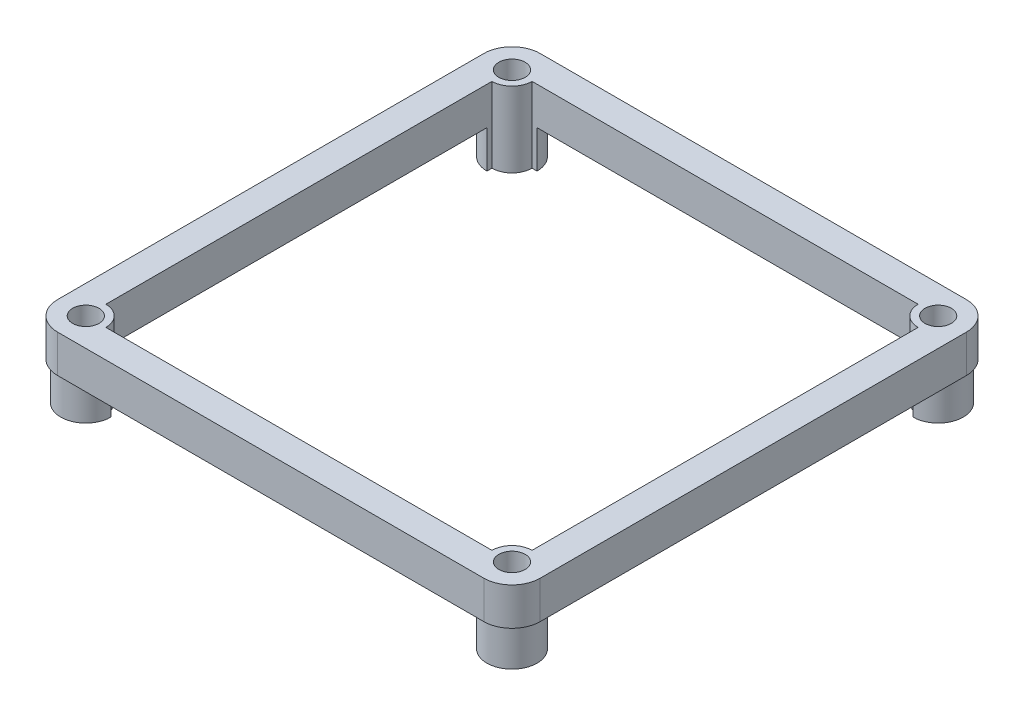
ISO-10303-21;
HEADER;
FILE_DESCRIPTION(('STEP AP214'),'2;1');
FILE_NAME('part.step','',(''),(''),'','','');
FILE_SCHEMA(('AUTOMOTIVE_DESIGN { 1 0 10303 214 1 1 1 1 }'));
ENDSEC;
DATA;
#1=APPLICATION_CONTEXT('core data for automotive mechanical design processes');
#2=APPLICATION_PROTOCOL_DEFINITION('international standard','automotive_design',2000,#1);
#3=PRODUCT_CONTEXT('',#1,'mechanical');
#4=PRODUCT('Part','Part','',(#3));
#5=PRODUCT_RELATED_PRODUCT_CATEGORY('part','',(#4));
#6=PRODUCT_DEFINITION_FORMATION('','',#4);
#7=PRODUCT_DEFINITION_CONTEXT('part definition',#1,'design');
#8=PRODUCT_DEFINITION('design','',#6,#7);
#9=PRODUCT_DEFINITION_SHAPE('','',#8);
#10=(LENGTH_UNIT() NAMED_UNIT(*) SI_UNIT(.MILLI.,.METRE.));
#11=(NAMED_UNIT(*) PLANE_ANGLE_UNIT() SI_UNIT($,.RADIAN.));
#12=(NAMED_UNIT(*) SI_UNIT($,.STERADIAN.) SOLID_ANGLE_UNIT());
#13=UNCERTAINTY_MEASURE_WITH_UNIT(LENGTH_MEASURE(1.E-05),#10,'distance_accuracy_value','');
#14=(GEOMETRIC_REPRESENTATION_CONTEXT(3) GLOBAL_UNCERTAINTY_ASSIGNED_CONTEXT((#13)) GLOBAL_UNIT_ASSIGNED_CONTEXT((#10,
#11,#12)) REPRESENTATION_CONTEXT('',''));
#15=CARTESIAN_POINT('',(0.,0.,0.));
#16=DIRECTION('',(0.,0.,1.));
#17=DIRECTION('',(1.,0.,0.));
#18=AXIS2_PLACEMENT_3D('',#15,#16,#17);
#19=CARTESIAN_POINT('',(0.,3.,-34.));
#20=DIRECTION('',(0.,1.,0.));
#21=DIRECTION('',(0.,0.,1.));
#22=AXIS2_PLACEMENT_3D('',#19,#20,#21);
#23=PLANE('',#22);
#24=CARTESIAN_POINT('',(0.,3.,-34.));
#25=DIRECTION('',(0.,1.,0.));
#26=DIRECTION('',(0.,0.,1.));
#27=AXIS2_PLACEMENT_3D('',#24,#25,#26);
#28=CIRCLE('',#27,2.25);
#29=CARTESIAN_POINT('',(0.,3.,-36.25));
#30=VERTEX_POINT('',#29);
#31=CARTESIAN_POINT('',(-2.25,3.,-34.));
#32=VERTEX_POINT('',#31);
#33=EDGE_CURVE('E366',#30,#32,#28,.T.);
#34=ORIENTED_EDGE('',*,*,#33,.F.);
#35=DIRECTION('',(-1.,0.,0.));
#36=VECTOR('',#35,1.);
#37=CARTESIAN_POINT('',(0.,3.,-36.25));
#38=LINE('',#37,#36);
#39=CARTESIAN_POINT('',(34.,3.,-36.25));
#40=VERTEX_POINT('',#39);
#41=EDGE_CURVE('E395',#40,#30,#38,.T.);
#42=ORIENTED_EDGE('',*,*,#41,.F.);
#43=CARTESIAN_POINT('',(34.,3.,-34.));
#44=DIRECTION('',(0.,1.,0.));
#45=DIRECTION('',(0.,0.,-1.));
#46=AXIS2_PLACEMENT_3D('',#43,#44,#45);
#47=CIRCLE('',#46,2.25);
#48=CARTESIAN_POINT('',(36.25,3.,-34.));
#49=VERTEX_POINT('',#48);
#50=EDGE_CURVE('E391',#49,#40,#47,.T.);
#51=ORIENTED_EDGE('',*,*,#50,.F.);
#52=DIRECTION('',(0.,0.,-1.));
#53=VECTOR('',#52,1.);
#54=CARTESIAN_POINT('',(36.25,3.,-34.));
#55=LINE('',#54,#53);
#56=CARTESIAN_POINT('',(36.25,3.,0.));
#57=VERTEX_POINT('',#56);
#58=EDGE_CURVE('E387',#57,#49,#55,.T.);
#59=ORIENTED_EDGE('',*,*,#58,.F.);
#60=CARTESIAN_POINT('',(34.,3.,0.));
#61=DIRECTION('',(0.,1.,0.));
#62=DIRECTION('',(0.,0.,-1.));
#63=AXIS2_PLACEMENT_3D('',#60,#61,#62);
#64=CIRCLE('',#63,2.25);
#65=CARTESIAN_POINT('',(34.,3.,2.25));
#66=VERTEX_POINT('',#65);
#67=EDGE_CURVE('E383',#66,#57,#64,.T.);
#68=ORIENTED_EDGE('',*,*,#67,.F.);
#69=DIRECTION('',(1.,0.,0.));
#70=VECTOR('',#69,1.);
#71=CARTESIAN_POINT('',(34.,3.,2.25));
#72=LINE('',#71,#70);
#73=CARTESIAN_POINT('',(0.,3.,2.25));
#74=VERTEX_POINT('',#73);
#75=EDGE_CURVE('E379',#74,#66,#72,.T.);
#76=ORIENTED_EDGE('',*,*,#75,.F.);
#77=CARTESIAN_POINT('',(0.,3.,0.));
#78=DIRECTION('',(0.,1.,0.));
#79=DIRECTION('',(0.,0.,-1.));
#80=AXIS2_PLACEMENT_3D('',#77,#78,#79);
#81=CIRCLE('',#80,2.25);
#82=CARTESIAN_POINT('',(-2.25,3.,0.));
#83=VERTEX_POINT('',#82);
#84=EDGE_CURVE('E375',#83,#74,#81,.T.);
#85=ORIENTED_EDGE('',*,*,#84,.F.);
#86=DIRECTION('',(0.,0.,1.));
#87=VECTOR('',#86,1.);
#88=CARTESIAN_POINT('',(-2.25,3.,0.));
#89=LINE('',#88,#87);
#90=EDGE_CURVE('E370',#32,#83,#89,.T.);
#91=ORIENTED_EDGE('',*,*,#90,.F.);
#92=EDGE_LOOP('',(#34,#42,#51,#59,#68,#76,#85,#91));
#93=FACE_BOUND('',#92,.T.);
#94=CARTESIAN_POINT('',(0.,3.,0.));
#95=DIRECTION('',(0.,1.,0.));
#96=DIRECTION('',(0.,0.,1.));
#97=AXIS2_PLACEMENT_3D('',#94,#95,#96);
#98=CIRCLE('',#97,2.);
#99=CARTESIAN_POINT('',(2.,3.,0.));
#100=VERTEX_POINT('',#99);
#101=CARTESIAN_POINT('',(0.,3.,-2.));
#102=VERTEX_POINT('',#101);
#103=EDGE_CURVE('E65',#100,#102,#98,.F.);
#104=ORIENTED_EDGE('',*,*,#103,.F.);
#105=DIRECTION('',(1.,0.,0.));
#106=VECTOR('',#105,1.);
#107=CARTESIAN_POINT('',(1.6,3.,0.));
#108=LINE('',#107,#106);
#109=CARTESIAN_POINT('',(32.,3.,0.));
#110=VERTEX_POINT('',#109);
#111=EDGE_CURVE('E337',#100,#110,#108,.T.);
#112=ORIENTED_EDGE('',*,*,#111,.T.);
#113=CARTESIAN_POINT('',(34.,3.,0.));
#114=DIRECTION('',(0.,1.,0.));
#115=DIRECTION('',(0.,0.,1.));
#116=AXIS2_PLACEMENT_3D('',#113,#114,#115);
#117=CIRCLE('',#116,2.);
#118=CARTESIAN_POINT('',(34.,3.,-2.));
#119=VERTEX_POINT('',#118);
#120=EDGE_CURVE('E282',#119,#110,#117,.F.);
#121=ORIENTED_EDGE('',*,*,#120,.F.);
#122=DIRECTION('',(0.,0.,-1.));
#123=VECTOR('',#122,1.);
#124=CARTESIAN_POINT('',(34.,3.,-1.6));
#125=LINE('',#124,#123);
#126=CARTESIAN_POINT('',(34.,3.,-32.));
#127=VERTEX_POINT('',#126);
#128=EDGE_CURVE('E328',#119,#127,#125,.T.);
#129=ORIENTED_EDGE('',*,*,#128,.T.);
#130=CARTESIAN_POINT('',(34.,3.,-34.));
#131=DIRECTION('',(0.,1.,0.));
#132=DIRECTION('',(0.,0.,1.));
#133=AXIS2_PLACEMENT_3D('',#130,#131,#132);
#134=CIRCLE('',#133,2.);
#135=CARTESIAN_POINT('',(32.,3.,-34.));
#136=VERTEX_POINT('',#135);
#137=EDGE_CURVE('E320',#136,#127,#134,.F.);
#138=ORIENTED_EDGE('',*,*,#137,.F.);
#139=DIRECTION('',(-1.,0.,0.));
#140=VECTOR('',#139,1.);
#141=CARTESIAN_POINT('',(32.4,3.,-34.));
#142=LINE('',#141,#140);
#143=CARTESIAN_POINT('',(2.,3.,-34.));
#144=VERTEX_POINT('',#143);
#145=EDGE_CURVE('E331',#136,#144,#142,.T.);
#146=ORIENTED_EDGE('',*,*,#145,.T.);
#147=CARTESIAN_POINT('',(0.,3.,-34.));
#148=DIRECTION('',(0.,1.,0.));
#149=DIRECTION('',(0.,0.,1.));
#150=AXIS2_PLACEMENT_3D('',#147,#148,#149);
#151=CIRCLE('',#150,2.);
#152=CARTESIAN_POINT('',(0.,3.,-32.));
#153=VERTEX_POINT('',#152);
#154=EDGE_CURVE('E433',#144,#153,#151,.T.);
#155=ORIENTED_EDGE('',*,*,#154,.T.);
#156=DIRECTION('',(0.,0.,1.));
#157=VECTOR('',#156,1.);
#158=CARTESIAN_POINT('',(0.,3.,-32.4));
#159=LINE('',#158,#157);
#160=EDGE_CURVE('E61',#153,#102,#159,.T.);
#161=ORIENTED_EDGE('',*,*,#160,.T.);
#162=EDGE_LOOP('',(#104,#112,#121,#129,#138,#146,#155,#161));
#163=FACE_BOUND('',#162,.T.);
#164=ADVANCED_FACE('F45',(#93,#163),#23,.F.);
#165=CARTESIAN_POINT('',(0.,6.,-34.));
#166=DIRECTION('',(0.,-1.,0.));
#167=DIRECTION('',(0.,0.,-1.));
#168=AXIS2_PLACEMENT_3D('',#165,#166,#167);
#169=CYLINDRICAL_SURFACE('',#168,2.);
#170=ORIENTED_EDGE('',*,*,#154,.F.);
#171=DIRECTION('',(0.,-1.,0.));
#172=VECTOR('',#171,1.);
#173=CARTESIAN_POINT('',(2.,6.,-34.));
#174=LINE('',#173,#172);
#175=CARTESIAN_POINT('',(2.,0.,-34.));
#176=VERTEX_POINT('',#175);
#177=EDGE_CURVE('E475',#144,#176,#174,.T.);
#178=ORIENTED_EDGE('',*,*,#177,.T.);
#179=CARTESIAN_POINT('',(0.,0.,-34.));
#180=DIRECTION('',(0.,1.,0.));
#181=DIRECTION('',(0.,0.,1.));
#182=AXIS2_PLACEMENT_3D('',#179,#180,#181);
#183=CIRCLE('',#182,2.);
#184=CARTESIAN_POINT('',(0.,0.,-32.));
#185=VERTEX_POINT('',#184);
#186=EDGE_CURVE('E461',#176,#185,#183,.T.);
#187=ORIENTED_EDGE('',*,*,#186,.T.);
#188=DIRECTION('',(0.,-1.,0.));
#189=VECTOR('',#188,1.);
#190=CARTESIAN_POINT('',(0.,6.,-32.));
#191=LINE('',#190,#189);
#192=EDGE_CURVE('E11',#153,#185,#191,.T.);
#193=ORIENTED_EDGE('',*,*,#192,.F.);
#194=EDGE_LOOP('',(#170,#178,#187,#193));
#195=FACE_BOUND('',#194,.T.);
#196=ADVANCED_FACE('F47',(#195),#169,.T.);
#197=CARTESIAN_POINT('',(0.,6.,-34.));
#198=DIRECTION('',(0.,1.,0.));
#199=DIRECTION('',(0.,0.,1.));
#200=AXIS2_PLACEMENT_3D('',#197,#198,#199);
#201=PLANE('',#200);
#202=DIRECTION('',(0.,0.,-1.));
#203=VECTOR('',#202,1.);
#204=CARTESIAN_POINT('',(0.,6.,-32.));
#205=LINE('',#204,#203);
#206=CARTESIAN_POINT('',(0.,6.,-1.6));
#207=VERTEX_POINT('',#206);
#208=CARTESIAN_POINT('',(0.,6.,-32.4));
#209=VERTEX_POINT('',#208);
#210=EDGE_CURVE('E465',#207,#209,#205,.T.);
#211=ORIENTED_EDGE('',*,*,#210,.T.);
#212=CARTESIAN_POINT('',(0.,6.,-34.));
#213=DIRECTION('',(0.,1.,0.));
#214=DIRECTION('',(0.,0.,1.));
#215=AXIS2_PLACEMENT_3D('',#212,#213,#214);
#216=CIRCLE('',#215,1.6);
#217=CARTESIAN_POINT('',(1.6,6.,-34.));
#218=VERTEX_POINT('',#217);
#219=EDGE_CURVE('E468',#209,#218,#216,.T.);
#220=ORIENTED_EDGE('',*,*,#219,.T.);
#221=DIRECTION('',(1.,0.,0.));
#222=VECTOR('',#221,1.);
#223=CARTESIAN_POINT('',(2.,6.,-34.));
#224=LINE('',#223,#222);
#225=CARTESIAN_POINT('',(32.4,6.,-34.));
#226=VERTEX_POINT('',#225);
#227=EDGE_CURVE('E472',#218,#226,#224,.T.);
#228=ORIENTED_EDGE('',*,*,#227,.T.);
#229=CARTESIAN_POINT('',(34.,6.,-34.));
#230=DIRECTION('',(0.,1.,0.));
#231=DIRECTION('',(0.,0.,1.));
#232=AXIS2_PLACEMENT_3D('',#229,#230,#231);
#233=CIRCLE('',#232,1.6);
#234=CARTESIAN_POINT('',(34.,6.,-32.4));
#235=VERTEX_POINT('',#234);
#236=EDGE_CURVE('E295',#226,#235,#233,.T.);
#237=ORIENTED_EDGE('',*,*,#236,.T.);
#238=DIRECTION('',(0.,0.,-1.));
#239=VECTOR('',#238,1.);
#240=CARTESIAN_POINT('',(34.,6.,-1.6));
#241=LINE('',#240,#239);
#242=CARTESIAN_POINT('',(34.,6.,-1.6));
#243=VERTEX_POINT('',#242);
#244=EDGE_CURVE('E327',#243,#235,#241,.T.);
#245=ORIENTED_EDGE('',*,*,#244,.F.);
#246=CARTESIAN_POINT('',(34.,6.,0.));
#247=DIRECTION('',(0.,1.,0.));
#248=DIRECTION('',(0.,0.,1.));
#249=AXIS2_PLACEMENT_3D('',#246,#247,#248);
#250=CIRCLE('',#249,1.6);
#251=CARTESIAN_POINT('',(32.4,6.,0.));
#252=VERTEX_POINT('',#251);
#253=EDGE_CURVE('E257',#243,#252,#250,.T.);
#254=ORIENTED_EDGE('',*,*,#253,.T.);
#255=DIRECTION('',(1.,0.,0.));
#256=VECTOR('',#255,1.);
#257=CARTESIAN_POINT('',(1.6,6.,0.));
#258=LINE('',#257,#256);
#259=CARTESIAN_POINT('',(1.6,6.,0.));
#260=VERTEX_POINT('',#259);
#261=EDGE_CURVE('E332',#260,#252,#258,.T.);
#262=ORIENTED_EDGE('',*,*,#261,.F.);
#263=CARTESIAN_POINT('',(0.,6.,0.));
#264=DIRECTION('',(0.,1.,0.));
#265=DIRECTION('',(0.,0.,1.));
#266=AXIS2_PLACEMENT_3D('',#263,#264,#265);
#267=CIRCLE('',#266,1.6);
#268=EDGE_CURVE('E213',#260,#207,#267,.T.);
#269=ORIENTED_EDGE('',*,*,#268,.T.);
#270=EDGE_LOOP('',(#211,#220,#228,#237,#245,#254,#262,#269));
#271=FACE_BOUND('',#270,.T.);
#272=CARTESIAN_POINT('',(0.,6.,0.));
#273=DIRECTION('',(0.,1.,0.));
#274=DIRECTION('',(0.,0.,1.));
#275=AXIS2_PLACEMENT_3D('',#272,#273,#274);
#276=CIRCLE('',#275,1.05);
#277=CARTESIAN_POINT('',(0.,6.,1.05));
#278=VERTEX_POINT('',#277);
#279=EDGE_CURVE('E233',#278,#278,#276,.T.);
#280=ORIENTED_EDGE('',*,*,#279,.F.);
#281=EDGE_LOOP('',(#280));
#282=FACE_BOUND('',#281,.T.);
#283=CARTESIAN_POINT('',(34.,6.,0.));
#284=DIRECTION('',(0.,1.,0.));
#285=DIRECTION('',(0.,0.,1.));
#286=AXIS2_PLACEMENT_3D('',#283,#284,#285);
#287=CIRCLE('',#286,1.05);
#288=CARTESIAN_POINT('',(34.,6.,1.05));
#289=VERTEX_POINT('',#288);
#290=EDGE_CURVE('E274',#289,#289,#287,.T.);
#291=ORIENTED_EDGE('',*,*,#290,.F.);
#292=EDGE_LOOP('',(#291));
#293=FACE_BOUND('',#292,.T.);
#294=CARTESIAN_POINT('',(34.,6.,-34.));
#295=DIRECTION('',(0.,1.,0.));
#296=DIRECTION('',(0.,0.,1.));
#297=AXIS2_PLACEMENT_3D('',#294,#295,#296);
#298=CIRCLE('',#297,1.05);
#299=CARTESIAN_POINT('',(34.,6.,-32.95));
#300=VERTEX_POINT('',#299);
#301=EDGE_CURVE('E312',#300,#300,#298,.T.);
#302=ORIENTED_EDGE('',*,*,#301,.F.);
#303=EDGE_LOOP('',(#302));
#304=FACE_BOUND('',#303,.T.);
#305=CARTESIAN_POINT('',(0.,6.,-34.));
#306=DIRECTION('',(0.,1.,0.));
#307=DIRECTION('',(0.,0.,1.));
#308=AXIS2_PLACEMENT_3D('',#305,#306,#307);
#309=CIRCLE('',#308,2.25);
#310=CARTESIAN_POINT('',(0.,6.,-36.25));
#311=VERTEX_POINT('',#310);
#312=CARTESIAN_POINT('',(-2.25,6.,-34.));
#313=VERTEX_POINT('',#312);
#314=EDGE_CURVE('E349',#311,#313,#309,.T.);
#315=ORIENTED_EDGE('',*,*,#314,.T.);
#316=DIRECTION('',(0.,0.,1.));
#317=VECTOR('',#316,1.);
#318=CARTESIAN_POINT('',(-2.25,6.,0.));
#319=LINE('',#318,#317);
#320=CARTESIAN_POINT('',(-2.25,6.,0.));
#321=VERTEX_POINT('',#320);
#322=EDGE_CURVE('E403',#313,#321,#319,.T.);
#323=ORIENTED_EDGE('',*,*,#322,.T.);
#324=CARTESIAN_POINT('',(0.,6.,0.));
#325=DIRECTION('',(0.,1.,0.));
#326=DIRECTION('',(0.,0.,-1.));
#327=AXIS2_PLACEMENT_3D('',#324,#325,#326);
#328=CIRCLE('',#327,2.25);
#329=CARTESIAN_POINT('',(0.,6.,2.25));
#330=VERTEX_POINT('',#329);
#331=EDGE_CURVE('E407',#321,#330,#328,.T.);
#332=ORIENTED_EDGE('',*,*,#331,.T.);
#333=DIRECTION('',(1.,0.,0.));
#334=VECTOR('',#333,1.);
#335=CARTESIAN_POINT('',(34.,6.,2.25));
#336=LINE('',#335,#334);
#337=CARTESIAN_POINT('',(34.,6.,2.25));
#338=VERTEX_POINT('',#337);
#339=EDGE_CURVE('E411',#330,#338,#336,.T.);
#340=ORIENTED_EDGE('',*,*,#339,.T.);
#341=CARTESIAN_POINT('',(34.,6.,0.));
#342=DIRECTION('',(0.,1.,0.));
#343=DIRECTION('',(0.,0.,-1.));
#344=AXIS2_PLACEMENT_3D('',#341,#342,#343);
#345=CIRCLE('',#344,2.25);
#346=CARTESIAN_POINT('',(36.25,6.,0.));
#347=VERTEX_POINT('',#346);
#348=EDGE_CURVE('E415',#338,#347,#345,.T.);
#349=ORIENTED_EDGE('',*,*,#348,.T.);
#350=DIRECTION('',(0.,0.,-1.));
#351=VECTOR('',#350,1.);
#352=CARTESIAN_POINT('',(36.25,6.,-34.));
#353=LINE('',#352,#351);
#354=CARTESIAN_POINT('',(36.25,6.,-34.));
#355=VERTEX_POINT('',#354);
#356=EDGE_CURVE('E419',#347,#355,#353,.T.);
#357=ORIENTED_EDGE('',*,*,#356,.T.);
#358=CARTESIAN_POINT('',(34.,6.,-34.));
#359=DIRECTION('',(0.,1.,0.));
#360=DIRECTION('',(0.,0.,-1.));
#361=AXIS2_PLACEMENT_3D('',#358,#359,#360);
#362=CIRCLE('',#361,2.25);
#363=CARTESIAN_POINT('',(34.,6.,-36.25));
#364=VERTEX_POINT('',#363);
#365=EDGE_CURVE('E423',#355,#364,#362,.T.);
#366=ORIENTED_EDGE('',*,*,#365,.T.);
#367=DIRECTION('',(-1.,0.,0.));
#368=VECTOR('',#367,1.);
#369=CARTESIAN_POINT('',(0.,6.,-36.25));
#370=LINE('',#369,#368);
#371=EDGE_CURVE('E371',#364,#311,#370,.T.);
#372=ORIENTED_EDGE('',*,*,#371,.T.);
#373=EDGE_LOOP('',(#315,#323,#332,#340,#349,#357,#366,#372));
#374=FACE_BOUND('',#373,.T.);
#375=CARTESIAN_POINT('',(0.,6.,-34.));
#376=DIRECTION('',(0.,1.,0.));
#377=DIRECTION('',(0.,0.,1.));
#378=AXIS2_PLACEMENT_3D('',#375,#376,#377);
#379=CIRCLE('',#378,1.05);
#380=CARTESIAN_POINT('',(0.,6.,-32.95));
#381=VERTEX_POINT('',#380);
#382=EDGE_CURVE('E457',#381,#381,#379,.T.);
#383=ORIENTED_EDGE('',*,*,#382,.F.);
#384=EDGE_LOOP('',(#383));
#385=FACE_BOUND('',#384,.T.);
#386=ADVANCED_FACE('F515',(#271,#282,#293,#304,#374,#385),#201,.T.);
#387=CARTESIAN_POINT('',(0.,0.,-34.));
#388=DIRECTION('',(0.,1.,0.));
#389=DIRECTION('',(0.,0.,1.));
#390=AXIS2_PLACEMENT_3D('',#387,#388,#389);
#391=PLANE('',#390);
#392=ORIENTED_EDGE('',*,*,#186,.F.);
#393=DIRECTION('',(1.,0.,0.));
#394=VECTOR('',#393,1.);
#395=CARTESIAN_POINT('',(2.,0.,-34.));
#396=LINE('',#395,#394);
#397=CARTESIAN_POINT('',(1.6,0.,-34.));
#398=VERTEX_POINT('',#397);
#399=EDGE_CURVE('E469',#398,#176,#396,.T.);
#400=ORIENTED_EDGE('',*,*,#399,.F.);
#401=CARTESIAN_POINT('',(0.,0.,-34.));
#402=DIRECTION('',(0.,1.,0.));
#403=DIRECTION('',(0.,0.,1.));
#404=AXIS2_PLACEMENT_3D('',#401,#402,#403);
#405=CIRCLE('',#404,1.6);
#406=CARTESIAN_POINT('',(0.,0.,-32.4));
#407=VERTEX_POINT('',#406);
#408=EDGE_CURVE('E483',#407,#398,#405,.T.);
#409=ORIENTED_EDGE('',*,*,#408,.F.);
#410=DIRECTION('',(0.,0.,-1.));
#411=VECTOR('',#410,1.);
#412=CARTESIAN_POINT('',(0.,0.,-32.));
#413=LINE('',#412,#411);
#414=EDGE_CURVE('E479',#185,#407,#413,.T.);
#415=ORIENTED_EDGE('',*,*,#414,.F.);
#416=EDGE_LOOP('',(#392,#400,#409,#415));
#417=FACE_BOUND('',#416,.T.);
#418=CARTESIAN_POINT('',(0.,0.,-34.));
#419=DIRECTION('',(0.,1.,0.));
#420=DIRECTION('',(0.,0.,1.));
#421=AXIS2_PLACEMENT_3D('',#418,#419,#420);
#422=CIRCLE('',#421,1.05);
#423=CARTESIAN_POINT('',(0.,0.,-32.95));
#424=VERTEX_POINT('',#423);
#425=EDGE_CURVE('E456',#424,#424,#422,.T.);
#426=ORIENTED_EDGE('',*,*,#425,.T.);
#427=EDGE_LOOP('',(#426));
#428=FACE_BOUND('',#427,.T.);
#429=ADVANCED_FACE('F505',(#417,#428),#391,.F.);
#430=CARTESIAN_POINT('',(0.,6.,-32.));
#431=DIRECTION('',(-1.,0.,0.));
#432=DIRECTION('',(0.,0.,1.));
#433=AXIS2_PLACEMENT_3D('',#430,#431,#432);
#434=PLANE('',#433);
#435=DIRECTION('',(0.,1.,0.));
#436=VECTOR('',#435,1.);
#437=CARTESIAN_POINT('',(0.,3.,-1.6));
#438=LINE('',#437,#436);
#439=CARTESIAN_POINT('',(0.,0.,-1.6));
#440=VERTEX_POINT('',#439);
#441=EDGE_CURVE('E220',#440,#207,#438,.T.);
#442=ORIENTED_EDGE('',*,*,#441,.F.);
#443=DIRECTION('',(0.,0.,-1.));
#444=VECTOR('',#443,1.);
#445=CARTESIAN_POINT('',(0.,0.,-2.));
#446=LINE('',#445,#444);
#447=CARTESIAN_POINT('',(0.,0.,-2.));
#448=VERTEX_POINT('',#447);
#449=EDGE_CURVE('E217',#440,#448,#446,.T.);
#450=ORIENTED_EDGE('',*,*,#449,.T.);
#451=DIRECTION('',(0.,-1.,0.));
#452=VECTOR('',#451,1.);
#453=CARTESIAN_POINT('',(0.,6.,-2.));
#454=LINE('',#453,#452);
#455=EDGE_CURVE('E205',#102,#448,#454,.T.);
#456=ORIENTED_EDGE('',*,*,#455,.F.);
#457=ORIENTED_EDGE('',*,*,#160,.F.);
#458=ORIENTED_EDGE('',*,*,#192,.T.);
#459=ORIENTED_EDGE('',*,*,#414,.T.);
#460=DIRECTION('',(0.,-1.,0.));
#461=VECTOR('',#460,1.);
#462=CARTESIAN_POINT('',(0.,6.,-32.4));
#463=LINE('',#462,#461);
#464=EDGE_CURVE('E54',#209,#407,#463,.T.);
#465=ORIENTED_EDGE('',*,*,#464,.F.);
#466=ORIENTED_EDGE('',*,*,#210,.F.);
#467=EDGE_LOOP('',(#442,#450,#456,#457,#458,#459,#465,#466));
#468=FACE_BOUND('',#467,.T.);
#469=ADVANCED_FACE('F218',(#468),#434,.F.);
#470=CARTESIAN_POINT('',(0.,6.,-34.));
#471=DIRECTION('',(0.,-1.,0.));
#472=DIRECTION('',(0.,0.,-1.));
#473=AXIS2_PLACEMENT_3D('',#470,#471,#472);
#474=CYLINDRICAL_SURFACE('',#473,1.6);
#475=ORIENTED_EDGE('',*,*,#408,.T.);
#476=DIRECTION('',(0.,-1.,0.));
#477=VECTOR('',#476,1.);
#478=CARTESIAN_POINT('',(1.6,6.,-34.));
#479=LINE('',#478,#477);
#480=EDGE_CURVE('E492',#218,#398,#479,.T.);
#481=ORIENTED_EDGE('',*,*,#480,.F.);
#482=ORIENTED_EDGE('',*,*,#219,.F.);
#483=ORIENTED_EDGE('',*,*,#464,.T.);
#484=EDGE_LOOP('',(#475,#481,#482,#483));
#485=FACE_BOUND('',#484,.T.);
#486=ADVANCED_FACE('F498',(#485),#474,.T.);
#487=CARTESIAN_POINT('',(2.,6.,-34.));
#488=DIRECTION('',(0.,0.,-1.));
#489=DIRECTION('',(-1.,0.,0.));
#490=AXIS2_PLACEMENT_3D('',#487,#488,#489);
#491=PLANE('',#490);
#492=DIRECTION('',(0.,1.,0.));
#493=VECTOR('',#492,1.);
#494=CARTESIAN_POINT('',(32.4,3.,-34.));
#495=LINE('',#494,#493);
#496=CARTESIAN_POINT('',(32.4,0.,-34.));
#497=VERTEX_POINT('',#496);
#498=EDGE_CURVE('E355',#497,#226,#495,.T.);
#499=ORIENTED_EDGE('',*,*,#498,.T.);
#500=ORIENTED_EDGE('',*,*,#227,.F.);
#501=ORIENTED_EDGE('',*,*,#480,.T.);
#502=ORIENTED_EDGE('',*,*,#399,.T.);
#503=ORIENTED_EDGE('',*,*,#177,.F.);
#504=ORIENTED_EDGE('',*,*,#145,.F.);
#505=DIRECTION('',(0.,-1.,0.));
#506=VECTOR('',#505,1.);
#507=CARTESIAN_POINT('',(32.,6.,-34.));
#508=LINE('',#507,#506);
#509=CARTESIAN_POINT('',(32.,0.,-34.));
#510=VERTEX_POINT('',#509);
#511=EDGE_CURVE('E289',#136,#510,#508,.T.);
#512=ORIENTED_EDGE('',*,*,#511,.T.);
#513=DIRECTION('',(1.,0.,0.));
#514=VECTOR('',#513,1.);
#515=CARTESIAN_POINT('',(32.,0.,-34.));
#516=LINE('',#515,#514);
#517=EDGE_CURVE('E304',#510,#497,#516,.T.);
#518=ORIENTED_EDGE('',*,*,#517,.T.);
#519=EDGE_LOOP('',(#499,#500,#501,#502,#503,#504,#512,#518));
#520=FACE_BOUND('',#519,.T.);
#521=ADVANCED_FACE('F509',(#520),#491,.F.);
#522=CARTESIAN_POINT('',(0.,6.,-34.));
#523=DIRECTION('',(0.,-1.,0.));
#524=DIRECTION('',(0.,0.,-1.));
#525=AXIS2_PLACEMENT_3D('',#522,#523,#524);
#526=CYLINDRICAL_SURFACE('',#525,1.05);
#527=ORIENTED_EDGE('',*,*,#382,.T.);
#528=EDGE_LOOP('',(#527));
#529=FACE_BOUND('',#528,.T.);
#530=ORIENTED_EDGE('',*,*,#425,.F.);
#531=EDGE_LOOP('',(#530));
#532=FACE_BOUND('',#531,.T.);
#533=ADVANCED_FACE('F603',(#529,#532),#526,.F.);
#534=CARTESIAN_POINT('',(0.,3.,-34.));
#535=DIRECTION('',(0.,1.,0.));
#536=DIRECTION('',(0.,0.,1.));
#537=AXIS2_PLACEMENT_3D('',#534,#535,#536);
#538=CYLINDRICAL_SURFACE('',#537,2.25);
#539=ORIENTED_EDGE('',*,*,#314,.F.);
#540=DIRECTION('',(0.,1.,0.));
#541=VECTOR('',#540,1.);
#542=CARTESIAN_POINT('',(0.,3.,-36.25));
#543=LINE('',#542,#541);
#544=EDGE_CURVE('E430',#30,#311,#543,.T.);
#545=ORIENTED_EDGE('',*,*,#544,.F.);
#546=ORIENTED_EDGE('',*,*,#33,.T.);
#547=DIRECTION('',(0.,1.,0.));
#548=VECTOR('',#547,1.);
#549=CARTESIAN_POINT('',(-2.25,3.,-34.));
#550=LINE('',#549,#548);
#551=EDGE_CURVE('E399',#32,#313,#550,.T.);
#552=ORIENTED_EDGE('',*,*,#551,.T.);
#553=EDGE_LOOP('',(#539,#545,#546,#552));
#554=FACE_BOUND('',#553,.T.);
#555=ADVANCED_FACE('F576',(#554),#538,.T.);
#556=CARTESIAN_POINT('',(0.,3.,-36.25));
#557=DIRECTION('',(0.,0.,-1.));
#558=DIRECTION('',(-1.,0.,0.));
#559=AXIS2_PLACEMENT_3D('',#556,#557,#558);
#560=PLANE('',#559);
#561=ORIENTED_EDGE('',*,*,#371,.F.);
#562=DIRECTION('',(0.,1.,0.));
#563=VECTOR('',#562,1.);
#564=CARTESIAN_POINT('',(34.,3.,-36.25));
#565=LINE('',#564,#563);
#566=EDGE_CURVE('E434',#40,#364,#565,.T.);
#567=ORIENTED_EDGE('',*,*,#566,.F.);
#568=ORIENTED_EDGE('',*,*,#41,.T.);
#569=ORIENTED_EDGE('',*,*,#544,.T.);
#570=EDGE_LOOP('',(#561,#567,#568,#569));
#571=FACE_BOUND('',#570,.T.);
#572=ADVANCED_FACE('F572',(#571),#560,.T.);
#573=CARTESIAN_POINT('',(34.,3.,-34.));
#574=DIRECTION('',(0.,1.,0.));
#575=DIRECTION('',(0.,0.,1.));
#576=AXIS2_PLACEMENT_3D('',#573,#574,#575);
#577=CYLINDRICAL_SURFACE('',#576,2.25);
#578=ORIENTED_EDGE('',*,*,#365,.F.);
#579=DIRECTION('',(0.,1.,0.));
#580=VECTOR('',#579,1.);
#581=CARTESIAN_POINT('',(36.25,3.,-34.));
#582=LINE('',#581,#580);
#583=EDGE_CURVE('E437',#49,#355,#582,.T.);
#584=ORIENTED_EDGE('',*,*,#583,.F.);
#585=ORIENTED_EDGE('',*,*,#50,.T.);
#586=ORIENTED_EDGE('',*,*,#566,.T.);
#587=EDGE_LOOP('',(#578,#584,#585,#586));
#588=FACE_BOUND('',#587,.T.);
#589=ADVANCED_FACE('F575',(#588),#577,.T.);
#590=CARTESIAN_POINT('',(36.25,3.,-34.));
#591=DIRECTION('',(1.,0.,0.));
#592=DIRECTION('',(0.,0.,-1.));
#593=AXIS2_PLACEMENT_3D('',#590,#591,#592);
#594=PLANE('',#593);
#595=ORIENTED_EDGE('',*,*,#356,.F.);
#596=DIRECTION('',(0.,1.,0.));
#597=VECTOR('',#596,1.);
#598=CARTESIAN_POINT('',(36.25,3.,0.));
#599=LINE('',#598,#597);
#600=EDGE_CURVE('E440',#57,#347,#599,.T.);
#601=ORIENTED_EDGE('',*,*,#600,.F.);
#602=ORIENTED_EDGE('',*,*,#58,.T.);
#603=ORIENTED_EDGE('',*,*,#583,.T.);
#604=EDGE_LOOP('',(#595,#601,#602,#603));
#605=FACE_BOUND('',#604,.T.);
#606=ADVANCED_FACE('F580',(#605),#594,.T.);
#607=CARTESIAN_POINT('',(34.,3.,0.));
#608=DIRECTION('',(0.,1.,0.));
#609=DIRECTION('',(0.,0.,1.));
#610=AXIS2_PLACEMENT_3D('',#607,#608,#609);
#611=CYLINDRICAL_SURFACE('',#610,2.25);
#612=ORIENTED_EDGE('',*,*,#348,.F.);
#613=DIRECTION('',(0.,1.,0.));
#614=VECTOR('',#613,1.);
#615=CARTESIAN_POINT('',(34.,3.,2.25));
#616=LINE('',#615,#614);
#617=EDGE_CURVE('E443',#66,#338,#616,.T.);
#618=ORIENTED_EDGE('',*,*,#617,.F.);
#619=ORIENTED_EDGE('',*,*,#67,.T.);
#620=ORIENTED_EDGE('',*,*,#600,.T.);
#621=EDGE_LOOP('',(#612,#618,#619,#620));
#622=FACE_BOUND('',#621,.T.);
#623=ADVANCED_FACE('F584',(#622),#611,.T.);
#624=CARTESIAN_POINT('',(34.,3.,2.25));
#625=DIRECTION('',(0.,0.,1.));
#626=DIRECTION('',(1.,0.,0.));
#627=AXIS2_PLACEMENT_3D('',#624,#625,#626);
#628=PLANE('',#627);
#629=ORIENTED_EDGE('',*,*,#339,.F.);
#630=DIRECTION('',(0.,1.,0.));
#631=VECTOR('',#630,1.);
#632=CARTESIAN_POINT('',(0.,3.,2.25));
#633=LINE('',#632,#631);
#634=EDGE_CURVE('E446',#74,#330,#633,.T.);
#635=ORIENTED_EDGE('',*,*,#634,.F.);
#636=ORIENTED_EDGE('',*,*,#75,.T.);
#637=ORIENTED_EDGE('',*,*,#617,.T.);
#638=EDGE_LOOP('',(#629,#635,#636,#637));
#639=FACE_BOUND('',#638,.T.);
#640=ADVANCED_FACE('F588',(#639),#628,.T.);
#641=CARTESIAN_POINT('',(0.,3.,0.));
#642=DIRECTION('',(0.,1.,0.));
#643=DIRECTION('',(0.,0.,1.));
#644=AXIS2_PLACEMENT_3D('',#641,#642,#643);
#645=CYLINDRICAL_SURFACE('',#644,2.25);
#646=ORIENTED_EDGE('',*,*,#331,.F.);
#647=DIRECTION('',(0.,1.,0.));
#648=VECTOR('',#647,1.);
#649=CARTESIAN_POINT('',(-2.25,3.,0.));
#650=LINE('',#649,#648);
#651=EDGE_CURVE('E449',#83,#321,#650,.T.);
#652=ORIENTED_EDGE('',*,*,#651,.F.);
#653=ORIENTED_EDGE('',*,*,#84,.T.);
#654=ORIENTED_EDGE('',*,*,#634,.T.);
#655=EDGE_LOOP('',(#646,#652,#653,#654));
#656=FACE_BOUND('',#655,.T.);
#657=ADVANCED_FACE('F592',(#656),#645,.T.);
#658=CARTESIAN_POINT('',(-2.25,3.,0.));
#659=DIRECTION('',(-1.,0.,0.));
#660=DIRECTION('',(0.,0.,1.));
#661=AXIS2_PLACEMENT_3D('',#658,#659,#660);
#662=PLANE('',#661);
#663=ORIENTED_EDGE('',*,*,#322,.F.);
#664=ORIENTED_EDGE('',*,*,#551,.F.);
#665=ORIENTED_EDGE('',*,*,#90,.T.);
#666=ORIENTED_EDGE('',*,*,#651,.T.);
#667=EDGE_LOOP('',(#663,#664,#665,#666));
#668=FACE_BOUND('',#667,.T.);
#669=ADVANCED_FACE('F596',(#668),#662,.T.);
#670=CARTESIAN_POINT('',(1.6,3.,0.));
#671=DIRECTION('',(0.,0.,1.));
#672=DIRECTION('',(1.,0.,0.));
#673=AXIS2_PLACEMENT_3D('',#670,#671,#672);
#674=PLANE('',#673);
#675=ORIENTED_EDGE('',*,*,#261,.T.);
#676=DIRECTION('',(0.,1.,0.));
#677=VECTOR('',#676,1.);
#678=CARTESIAN_POINT('',(32.4,3.,0.));
#679=LINE('',#678,#677);
#680=CARTESIAN_POINT('',(32.4,0.,0.));
#681=VERTEX_POINT('',#680);
#682=EDGE_CURVE('E345',#681,#252,#679,.T.);
#683=ORIENTED_EDGE('',*,*,#682,.F.);
#684=DIRECTION('',(-1.,0.,0.));
#685=VECTOR('',#684,1.);
#686=CARTESIAN_POINT('',(32.,0.,0.));
#687=LINE('',#686,#685);
#688=CARTESIAN_POINT('',(32.,0.,0.));
#689=VERTEX_POINT('',#688);
#690=EDGE_CURVE('E258',#681,#689,#687,.T.);
#691=ORIENTED_EDGE('',*,*,#690,.T.);
#692=DIRECTION('',(0.,-1.,0.));
#693=VECTOR('',#692,1.);
#694=CARTESIAN_POINT('',(32.,6.,0.));
#695=LINE('',#694,#693);
#696=EDGE_CURVE('E254',#110,#689,#695,.T.);
#697=ORIENTED_EDGE('',*,*,#696,.F.);
#698=ORIENTED_EDGE('',*,*,#111,.F.);
#699=DIRECTION('',(0.,-1.,0.));
#700=VECTOR('',#699,1.);
#701=CARTESIAN_POINT('',(2.,6.,0.));
#702=LINE('',#701,#700);
#703=CARTESIAN_POINT('',(2.,0.,0.));
#704=VERTEX_POINT('',#703);
#705=EDGE_CURVE('E214',#100,#704,#702,.T.);
#706=ORIENTED_EDGE('',*,*,#705,.T.);
#707=DIRECTION('',(-1.,0.,0.));
#708=VECTOR('',#707,1.);
#709=CARTESIAN_POINT('',(2.,0.,0.));
#710=LINE('',#709,#708);
#711=CARTESIAN_POINT('',(1.6,0.,0.));
#712=VERTEX_POINT('',#711);
#713=EDGE_CURVE('E231',#704,#712,#710,.T.);
#714=ORIENTED_EDGE('',*,*,#713,.T.);
#715=DIRECTION('',(0.,1.,0.));
#716=VECTOR('',#715,1.);
#717=CARTESIAN_POINT('',(1.6,3.,0.));
#718=LINE('',#717,#716);
#719=EDGE_CURVE('E350',#712,#260,#718,.T.);
#720=ORIENTED_EDGE('',*,*,#719,.T.);
#721=EDGE_LOOP('',(#675,#683,#691,#697,#698,#706,#714,#720));
#722=FACE_BOUND('',#721,.T.);
#723=ADVANCED_FACE('F526',(#722),#674,.F.);
#724=CARTESIAN_POINT('',(34.,3.,-1.6));
#725=DIRECTION('',(1.,0.,0.));
#726=DIRECTION('',(0.,0.,-1.));
#727=AXIS2_PLACEMENT_3D('',#724,#725,#726);
#728=PLANE('',#727);
#729=ORIENTED_EDGE('',*,*,#244,.T.);
#730=DIRECTION('',(0.,1.,0.));
#731=VECTOR('',#730,1.);
#732=CARTESIAN_POINT('',(34.,3.,-32.4));
#733=LINE('',#732,#731);
#734=CARTESIAN_POINT('',(34.,0.,-32.4));
#735=VERTEX_POINT('',#734);
#736=EDGE_CURVE('E359',#735,#235,#733,.T.);
#737=ORIENTED_EDGE('',*,*,#736,.F.);
#738=DIRECTION('',(0.,0.,1.));
#739=VECTOR('',#738,1.);
#740=CARTESIAN_POINT('',(34.,0.,-32.));
#741=LINE('',#740,#739);
#742=CARTESIAN_POINT('',(34.,0.,-32.));
#743=VERTEX_POINT('',#742);
#744=EDGE_CURVE('E296',#735,#743,#741,.T.);
#745=ORIENTED_EDGE('',*,*,#744,.T.);
#746=DIRECTION('',(0.,-1.,0.));
#747=VECTOR('',#746,1.);
#748=CARTESIAN_POINT('',(34.,6.,-32.));
#749=LINE('',#748,#747);
#750=EDGE_CURVE('E292',#127,#743,#749,.T.);
#751=ORIENTED_EDGE('',*,*,#750,.F.);
#752=ORIENTED_EDGE('',*,*,#128,.F.);
#753=DIRECTION('',(0.,-1.,0.));
#754=VECTOR('',#753,1.);
#755=CARTESIAN_POINT('',(34.,6.,-2.));
#756=LINE('',#755,#754);
#757=CARTESIAN_POINT('',(34.,0.,-2.));
#758=VERTEX_POINT('',#757);
#759=EDGE_CURVE('E251',#119,#758,#756,.T.);
#760=ORIENTED_EDGE('',*,*,#759,.T.);
#761=DIRECTION('',(0.,0.,1.));
#762=VECTOR('',#761,1.);
#763=CARTESIAN_POINT('',(34.,0.,-2.));
#764=LINE('',#763,#762);
#765=CARTESIAN_POINT('',(34.,0.,-1.6));
#766=VERTEX_POINT('',#765);
#767=EDGE_CURVE('E266',#758,#766,#764,.T.);
#768=ORIENTED_EDGE('',*,*,#767,.T.);
#769=DIRECTION('',(0.,1.,0.));
#770=VECTOR('',#769,1.);
#771=CARTESIAN_POINT('',(34.,3.,-1.6));
#772=LINE('',#771,#770);
#773=EDGE_CURVE('E340',#766,#243,#772,.T.);
#774=ORIENTED_EDGE('',*,*,#773,.T.);
#775=EDGE_LOOP('',(#729,#737,#745,#751,#752,#760,#768,#774));
#776=FACE_BOUND('',#775,.T.);
#777=ADVANCED_FACE('F535',(#776),#728,.F.);
#778=CARTESIAN_POINT('',(34.,6.,-34.));
#779=DIRECTION('',(0.,-1.,0.));
#780=DIRECTION('',(0.,0.,-1.));
#781=AXIS2_PLACEMENT_3D('',#778,#779,#780);
#782=CYLINDRICAL_SURFACE('',#781,2.);
#783=ORIENTED_EDGE('',*,*,#511,.F.);
#784=ORIENTED_EDGE('',*,*,#137,.T.);
#785=ORIENTED_EDGE('',*,*,#750,.T.);
#786=CARTESIAN_POINT('',(34.,0.,-34.));
#787=DIRECTION('',(0.,1.,0.));
#788=DIRECTION('',(0.,0.,-1.));
#789=AXIS2_PLACEMENT_3D('',#786,#787,#788);
#790=CIRCLE('',#789,2.);
#791=EDGE_CURVE('E308',#743,#510,#790,.T.);
#792=ORIENTED_EDGE('',*,*,#791,.T.);
#793=EDGE_LOOP('',(#783,#784,#785,#792));
#794=FACE_BOUND('',#793,.T.);
#795=ADVANCED_FACE('F555',(#794),#782,.T.);
#796=CARTESIAN_POINT('',(34.,0.,-34.));
#797=DIRECTION('',(0.,-1.,0.));
#798=DIRECTION('',(0.,0.,-1.));
#799=AXIS2_PLACEMENT_3D('',#796,#797,#798);
#800=PLANE('',#799);
#801=ORIENTED_EDGE('',*,*,#791,.F.);
#802=ORIENTED_EDGE('',*,*,#744,.F.);
#803=CARTESIAN_POINT('',(34.,0.,-34.));
#804=DIRECTION('',(0.,1.,0.));
#805=DIRECTION('',(0.,0.,1.));
#806=AXIS2_PLACEMENT_3D('',#803,#804,#805);
#807=CIRCLE('',#806,1.6);
#808=EDGE_CURVE('E300',#497,#735,#807,.T.);
#809=ORIENTED_EDGE('',*,*,#808,.F.);
#810=ORIENTED_EDGE('',*,*,#517,.F.);
#811=EDGE_LOOP('',(#801,#802,#809,#810));
#812=FACE_BOUND('',#811,.T.);
#813=CARTESIAN_POINT('',(34.,0.,-34.));
#814=DIRECTION('',(0.,1.,0.));
#815=DIRECTION('',(0.,0.,1.));
#816=AXIS2_PLACEMENT_3D('',#813,#814,#815);
#817=CIRCLE('',#816,1.05);
#818=CARTESIAN_POINT('',(34.,0.,-32.95));
#819=VERTEX_POINT('',#818);
#820=EDGE_CURVE('E316',#819,#819,#817,.T.);
#821=ORIENTED_EDGE('',*,*,#820,.T.);
#822=EDGE_LOOP('',(#821));
#823=FACE_BOUND('',#822,.T.);
#824=ADVANCED_FACE('F551',(#812,#823),#800,.T.);
#825=CARTESIAN_POINT('',(34.,6.,-34.));
#826=DIRECTION('',(0.,-1.,0.));
#827=DIRECTION('',(0.,0.,-1.));
#828=AXIS2_PLACEMENT_3D('',#825,#826,#827);
#829=CYLINDRICAL_SURFACE('',#828,1.6);
#830=ORIENTED_EDGE('',*,*,#808,.T.);
#831=ORIENTED_EDGE('',*,*,#736,.T.);
#832=ORIENTED_EDGE('',*,*,#236,.F.);
#833=ORIENTED_EDGE('',*,*,#498,.F.);
#834=EDGE_LOOP('',(#830,#831,#832,#833));
#835=FACE_BOUND('',#834,.T.);
#836=ADVANCED_FACE('F548',(#835),#829,.T.);
#837=CARTESIAN_POINT('',(34.,6.,-34.));
#838=DIRECTION('',(0.,-1.,0.));
#839=DIRECTION('',(0.,0.,-1.));
#840=AXIS2_PLACEMENT_3D('',#837,#838,#839);
#841=CYLINDRICAL_SURFACE('',#840,1.05);
#842=ORIENTED_EDGE('',*,*,#301,.T.);
#843=EDGE_LOOP('',(#842));
#844=FACE_BOUND('',#843,.T.);
#845=ORIENTED_EDGE('',*,*,#820,.F.);
#846=EDGE_LOOP('',(#845));
#847=FACE_BOUND('',#846,.T.);
#848=ADVANCED_FACE('F702',(#844,#847),#841,.F.);
#849=CARTESIAN_POINT('',(34.,6.,0.));
#850=DIRECTION('',(0.,-1.,0.));
#851=DIRECTION('',(0.,0.,-1.));
#852=AXIS2_PLACEMENT_3D('',#849,#850,#851);
#853=CYLINDRICAL_SURFACE('',#852,2.);
#854=ORIENTED_EDGE('',*,*,#759,.F.);
#855=ORIENTED_EDGE('',*,*,#120,.T.);
#856=ORIENTED_EDGE('',*,*,#696,.T.);
#857=CARTESIAN_POINT('',(34.,0.,0.));
#858=DIRECTION('',(0.,1.,0.));
#859=DIRECTION('',(0.,0.,-1.));
#860=AXIS2_PLACEMENT_3D('',#857,#858,#859);
#861=CIRCLE('',#860,2.);
#862=EDGE_CURVE('E270',#689,#758,#861,.T.);
#863=ORIENTED_EDGE('',*,*,#862,.T.);
#864=EDGE_LOOP('',(#854,#855,#856,#863));
#865=FACE_BOUND('',#864,.T.);
#866=ADVANCED_FACE('F531',(#865),#853,.T.);
#867=CARTESIAN_POINT('',(34.,0.,0.));
#868=DIRECTION('',(0.,-1.,0.));
#869=DIRECTION('',(0.,0.,-1.));
#870=AXIS2_PLACEMENT_3D('',#867,#868,#869);
#871=PLANE('',#870);
#872=ORIENTED_EDGE('',*,*,#862,.F.);
#873=ORIENTED_EDGE('',*,*,#690,.F.);
#874=CARTESIAN_POINT('',(34.,0.,0.));
#875=DIRECTION('',(0.,1.,0.));
#876=DIRECTION('',(0.,0.,1.));
#877=AXIS2_PLACEMENT_3D('',#874,#875,#876);
#878=CIRCLE('',#877,1.6);
#879=EDGE_CURVE('E262',#766,#681,#878,.T.);
#880=ORIENTED_EDGE('',*,*,#879,.F.);
#881=ORIENTED_EDGE('',*,*,#767,.F.);
#882=EDGE_LOOP('',(#872,#873,#880,#881));
#883=FACE_BOUND('',#882,.T.);
#884=CARTESIAN_POINT('',(34.,0.,0.));
#885=DIRECTION('',(0.,1.,0.));
#886=DIRECTION('',(0.,0.,1.));
#887=AXIS2_PLACEMENT_3D('',#884,#885,#886);
#888=CIRCLE('',#887,1.05);
#889=CARTESIAN_POINT('',(34.,0.,1.05));
#890=VERTEX_POINT('',#889);
#891=EDGE_CURVE('E278',#890,#890,#888,.T.);
#892=ORIENTED_EDGE('',*,*,#891,.T.);
#893=EDGE_LOOP('',(#892));
#894=FACE_BOUND('',#893,.T.);
#895=ADVANCED_FACE('F539',(#883,#894),#871,.T.);
#896=CARTESIAN_POINT('',(34.,6.,0.));
#897=DIRECTION('',(0.,-1.,0.));
#898=DIRECTION('',(0.,0.,-1.));
#899=AXIS2_PLACEMENT_3D('',#896,#897,#898);
#900=CYLINDRICAL_SURFACE('',#899,1.6);
#901=ORIENTED_EDGE('',*,*,#879,.T.);
#902=ORIENTED_EDGE('',*,*,#682,.T.);
#903=ORIENTED_EDGE('',*,*,#253,.F.);
#904=ORIENTED_EDGE('',*,*,#773,.F.);
#905=EDGE_LOOP('',(#901,#902,#903,#904));
#906=FACE_BOUND('',#905,.T.);
#907=ADVANCED_FACE('F543',(#906),#900,.T.);
#908=CARTESIAN_POINT('',(34.,6.,0.));
#909=DIRECTION('',(0.,-1.,0.));
#910=DIRECTION('',(0.,0.,-1.));
#911=AXIS2_PLACEMENT_3D('',#908,#909,#910);
#912=CYLINDRICAL_SURFACE('',#911,1.05);
#913=ORIENTED_EDGE('',*,*,#290,.T.);
#914=EDGE_LOOP('',(#913));
#915=FACE_BOUND('',#914,.T.);
#916=ORIENTED_EDGE('',*,*,#891,.F.);
#917=EDGE_LOOP('',(#916));
#918=FACE_BOUND('',#917,.T.);
#919=ADVANCED_FACE('F730',(#915,#918),#912,.F.);
#920=CARTESIAN_POINT('',(0.,6.,0.));
#921=DIRECTION('',(0.,-1.,0.));
#922=DIRECTION('',(0.,0.,-1.));
#923=AXIS2_PLACEMENT_3D('',#920,#921,#922);
#924=CYLINDRICAL_SURFACE('',#923,2.);
#925=ORIENTED_EDGE('',*,*,#705,.F.);
#926=ORIENTED_EDGE('',*,*,#103,.T.);
#927=ORIENTED_EDGE('',*,*,#455,.T.);
#928=CARTESIAN_POINT('',(0.,0.,0.));
#929=DIRECTION('',(0.,1.,0.));
#930=DIRECTION('',(0.,0.,1.));
#931=AXIS2_PLACEMENT_3D('',#928,#929,#930);
#932=CIRCLE('',#931,2.);
#933=EDGE_CURVE('E210',#448,#704,#932,.T.);
#934=ORIENTED_EDGE('',*,*,#933,.T.);
#935=EDGE_LOOP('',(#925,#926,#927,#934));
#936=FACE_BOUND('',#935,.T.);
#937=ADVANCED_FACE('F208',(#936),#924,.T.);
#938=CARTESIAN_POINT('',(0.,0.,0.));
#939=DIRECTION('',(0.,1.,0.));
#940=DIRECTION('',(0.,0.,1.));
#941=AXIS2_PLACEMENT_3D('',#938,#939,#940);
#942=PLANE('',#941);
#943=ORIENTED_EDGE('',*,*,#933,.F.);
#944=ORIENTED_EDGE('',*,*,#449,.F.);
#945=CARTESIAN_POINT('',(0.,0.,0.));
#946=DIRECTION('',(0.,1.,0.));
#947=DIRECTION('',(0.,0.,1.));
#948=AXIS2_PLACEMENT_3D('',#945,#946,#947);
#949=CIRCLE('',#948,1.6);
#950=EDGE_CURVE('E225',#712,#440,#949,.T.);
#951=ORIENTED_EDGE('',*,*,#950,.F.);
#952=ORIENTED_EDGE('',*,*,#713,.F.);
#953=EDGE_LOOP('',(#943,#944,#951,#952));
#954=FACE_BOUND('',#953,.T.);
#955=CARTESIAN_POINT('',(0.,0.,0.));
#956=DIRECTION('',(0.,1.,0.));
#957=DIRECTION('',(0.,0.,1.));
#958=AXIS2_PLACEMENT_3D('',#955,#956,#957);
#959=CIRCLE('',#958,1.05);
#960=CARTESIAN_POINT('',(0.,0.,1.05));
#961=VERTEX_POINT('',#960);
#962=EDGE_CURVE('E238',#961,#961,#959,.T.);
#963=ORIENTED_EDGE('',*,*,#962,.T.);
#964=EDGE_LOOP('',(#963));
#965=FACE_BOUND('',#964,.T.);
#966=ADVANCED_FACE('F228',(#954,#965),#942,.F.);
#967=CARTESIAN_POINT('',(0.,6.,0.));
#968=DIRECTION('',(0.,-1.,0.));
#969=DIRECTION('',(0.,0.,-1.));
#970=AXIS2_PLACEMENT_3D('',#967,#968,#969);
#971=CYLINDRICAL_SURFACE('',#970,1.6);
#972=ORIENTED_EDGE('',*,*,#950,.T.);
#973=ORIENTED_EDGE('',*,*,#441,.T.);
#974=ORIENTED_EDGE('',*,*,#268,.F.);
#975=ORIENTED_EDGE('',*,*,#719,.F.);
#976=EDGE_LOOP('',(#972,#973,#974,#975));
#977=FACE_BOUND('',#976,.T.);
#978=ADVANCED_FACE('F521',(#977),#971,.T.);
#979=CARTESIAN_POINT('',(0.,6.,0.));
#980=DIRECTION('',(0.,-1.,0.));
#981=DIRECTION('',(0.,0.,-1.));
#982=AXIS2_PLACEMENT_3D('',#979,#980,#981);
#983=CYLINDRICAL_SURFACE('',#982,1.05);
#984=ORIENTED_EDGE('',*,*,#279,.T.);
#985=EDGE_LOOP('',(#984));
#986=FACE_BOUND('',#985,.T.);
#987=ORIENTED_EDGE('',*,*,#962,.F.);
#988=EDGE_LOOP('',(#987));
#989=FACE_BOUND('',#988,.T.);
#990=ADVANCED_FACE('F758',(#986,#989),#983,.F.);
#991=CLOSED_SHELL('',(#164,#196,#386,#429,#469,#486,#521,#533,#555,#572,#589,#606,#623,#640,
#657,#669,#723,#777,#795,#824,#836,#848,#866,#895,#907,#919,#937,#966,#978,#990));
#992=MANIFOLD_SOLID_BREP('B2',#991);
#993=ADVANCED_BREP_SHAPE_REPRESENTATION('',(#18,#992),#14);
#994=SHAPE_DEFINITION_REPRESENTATION(#9,#993);
ENDSEC;
END-ISO-10303-21;
